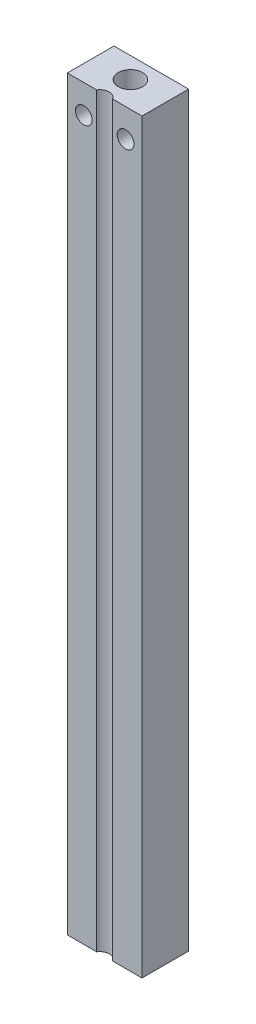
ISO-10303-21;
HEADER;
FILE_DESCRIPTION(('STEP AP214'),'2;1');
FILE_NAME('part.step','',(''),(''),'','','');
FILE_SCHEMA(('AUTOMOTIVE_DESIGN { 1 0 10303 214 1 1 1 1 }'));
ENDSEC;
DATA;
#1=APPLICATION_CONTEXT('core data for automotive mechanical design processes');
#2=APPLICATION_PROTOCOL_DEFINITION('international standard','automotive_design',2000,#1);
#3=PRODUCT_CONTEXT('',#1,'mechanical');
#4=PRODUCT('Part','Part','',(#3));
#5=PRODUCT_RELATED_PRODUCT_CATEGORY('part','',(#4));
#6=PRODUCT_DEFINITION_FORMATION('','',#4);
#7=PRODUCT_DEFINITION_CONTEXT('part definition',#1,'design');
#8=PRODUCT_DEFINITION('design','',#6,#7);
#9=PRODUCT_DEFINITION_SHAPE('','',#8);
#10=(LENGTH_UNIT() NAMED_UNIT(*) SI_UNIT(.MILLI.,.METRE.));
#11=(NAMED_UNIT(*) PLANE_ANGLE_UNIT() SI_UNIT($,.RADIAN.));
#12=(NAMED_UNIT(*) SI_UNIT($,.STERADIAN.) SOLID_ANGLE_UNIT());
#13=UNCERTAINTY_MEASURE_WITH_UNIT(LENGTH_MEASURE(1.E-05),#10,'distance_accuracy_value','');
#14=(GEOMETRIC_REPRESENTATION_CONTEXT(3) GLOBAL_UNCERTAINTY_ASSIGNED_CONTEXT((#13)) GLOBAL_UNIT_ASSIGNED_CONTEXT((#10,
#11,#12)) REPRESENTATION_CONTEXT('',''));
#15=CARTESIAN_POINT('',(0.,0.,0.));
#16=DIRECTION('',(0.,0.,1.));
#17=DIRECTION('',(1.,0.,0.));
#18=AXIS2_PLACEMENT_3D('',#15,#16,#17);
#19=CARTESIAN_POINT('',(0.,127.,0.));
#20=DIRECTION('',(1.,0.,0.));
#21=DIRECTION('',(0.,0.,-1.));
#22=AXIS2_PLACEMENT_3D('',#19,#20,#21);
#23=PLANE('',#22);
#24=DIRECTION('',(0.,0.,1.));
#25=VECTOR('',#24,1.);
#26=CARTESIAN_POINT('',(0.,0.,0.));
#27=LINE('',#26,#25);
#28=CARTESIAN_POINT('',(0.,0.,-7.9375));
#29=VERTEX_POINT('',#28);
#30=CARTESIAN_POINT('',(0.,0.,0.));
#31=VERTEX_POINT('',#30);
#32=EDGE_CURVE('E82',#29,#31,#27,.T.);
#33=ORIENTED_EDGE('',*,*,#32,.T.);
#34=DIRECTION('',(0.,-1.,0.));
#35=VECTOR('',#34,1.);
#36=CARTESIAN_POINT('',(0.,127.,0.));
#37=LINE('',#36,#35);
#38=CARTESIAN_POINT('',(0.,127.,0.));
#39=VERTEX_POINT('',#38);
#40=EDGE_CURVE('E11',#39,#31,#37,.T.);
#41=ORIENTED_EDGE('',*,*,#40,.F.);
#42=DIRECTION('',(0.,0.,1.));
#43=VECTOR('',#42,1.);
#44=CARTESIAN_POINT('',(0.,127.,0.));
#45=LINE('',#44,#43);
#46=CARTESIAN_POINT('',(0.,127.,-7.9375));
#47=VERTEX_POINT('',#46);
#48=EDGE_CURVE('E110',#47,#39,#45,.T.);
#49=ORIENTED_EDGE('',*,*,#48,.F.);
#50=DIRECTION('',(0.,-1.,0.));
#51=VECTOR('',#50,1.);
#52=CARTESIAN_POINT('',(0.,127.,-7.9375));
#53=LINE('',#52,#51);
#54=EDGE_CURVE('E95',#47,#29,#53,.T.);
#55=ORIENTED_EDGE('',*,*,#54,.T.);
#56=EDGE_LOOP('',(#33,#41,#49,#55));
#57=FACE_BOUND('',#56,.T.);
#58=ADVANCED_FACE('F26',(#57),#23,.F.);
#59=CARTESIAN_POINT('',(0.,127.,0.));
#60=DIRECTION('',(0.,0.,-1.));
#61=DIRECTION('',(-1.,0.,0.));
#62=AXIS2_PLACEMENT_3D('',#59,#60,#61);
#63=PLANE('',#62);
#64=CARTESIAN_POINT('',(2.794,122.174,0.));
#65=DIRECTION('',(0.,0.,1.));
#66=DIRECTION('',(1.,0.,0.));
#67=AXIS2_PLACEMENT_3D('',#64,#65,#66);
#68=CIRCLE('',#67,1.4224);
#69=CARTESIAN_POINT('',(4.2164,122.174,0.));
#70=VERTEX_POINT('',#69);
#71=EDGE_CURVE('E180',#70,#70,#68,.T.);
#72=ORIENTED_EDGE('',*,*,#71,.F.);
#73=EDGE_LOOP('',(#72));
#74=FACE_BOUND('',#73,.T.);
#75=DIRECTION('',(1.,0.,0.));
#76=VECTOR('',#75,1.);
#77=CARTESIAN_POINT('',(0.,0.,0.));
#78=LINE('',#77,#76);
#79=CARTESIAN_POINT('',(4.99401106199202,0.,0.));
#80=VERTEX_POINT('',#79);
#81=EDGE_CURVE('E78',#31,#80,#78,.T.);
#82=ORIENTED_EDGE('',*,*,#81,.T.);
#83=DIRECTION('',(0.,-1.,0.));
#84=VECTOR('',#83,1.);
#85=CARTESIAN_POINT('',(4.99401106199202,127.,0.));
#86=LINE('',#85,#84);
#87=CARTESIAN_POINT('',(4.99401106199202,127.,0.));
#88=VERTEX_POINT('',#87);
#89=EDGE_CURVE('E33',#88,#80,#86,.T.);
#90=ORIENTED_EDGE('',*,*,#89,.F.);
#91=DIRECTION('',(1.,0.,0.));
#92=VECTOR('',#91,1.);
#93=CARTESIAN_POINT('',(0.,127.,0.));
#94=LINE('',#93,#92);
#95=EDGE_CURVE('E91',#39,#88,#94,.T.);
#96=ORIENTED_EDGE('',*,*,#95,.F.);
#97=ORIENTED_EDGE('',*,*,#40,.T.);
#98=EDGE_LOOP('',(#82,#90,#96,#97));
#99=FACE_BOUND('',#98,.T.);
#100=ADVANCED_FACE('F90',(#74,#99),#63,.F.);
#101=CARTESIAN_POINT('',(6.35,127.,0.8255));
#102=DIRECTION('',(0.,-1.,0.));
#103=DIRECTION('',(0.,0.,-1.));
#104=AXIS2_PLACEMENT_3D('',#101,#102,#103);
#105=CYLINDRICAL_SURFACE('',#104,1.5875);
#106=CARTESIAN_POINT('',(6.35,0.,0.8255));
#107=DIRECTION('',(0.,-1.,0.));
#108=DIRECTION('',(0.,0.,1.));
#109=AXIS2_PLACEMENT_3D('',#106,#107,#108);
#110=CIRCLE('',#109,1.5875);
#111=CARTESIAN_POINT('',(7.70598893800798,0.,0.));
#112=VERTEX_POINT('',#111);
#113=EDGE_CURVE('E84',#80,#112,#110,.T.);
#114=ORIENTED_EDGE('',*,*,#113,.T.);
#115=DIRECTION('',(0.,-1.,0.));
#116=VECTOR('',#115,1.);
#117=CARTESIAN_POINT('',(7.70598893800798,127.,0.));
#118=LINE('',#117,#116);
#119=CARTESIAN_POINT('',(7.70598893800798,127.,0.));
#120=VERTEX_POINT('',#119);
#121=EDGE_CURVE('E126',#120,#112,#118,.T.);
#122=ORIENTED_EDGE('',*,*,#121,.F.);
#123=CARTESIAN_POINT('',(6.35,127.,0.8255));
#124=DIRECTION('',(0.,-1.,0.));
#125=DIRECTION('',(0.,0.,1.));
#126=AXIS2_PLACEMENT_3D('',#123,#124,#125);
#127=CIRCLE('',#126,1.5875);
#128=EDGE_CURVE('E113',#88,#120,#127,.T.);
#129=ORIENTED_EDGE('',*,*,#128,.F.);
#130=ORIENTED_EDGE('',*,*,#89,.T.);
#131=EDGE_LOOP('',(#114,#122,#129,#130));
#132=FACE_BOUND('',#131,.T.);
#133=ADVANCED_FACE('F130',(#132),#105,.F.);
#134=CARTESIAN_POINT('',(7.70598893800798,127.,0.));
#135=DIRECTION('',(0.,0.,-1.));
#136=DIRECTION('',(-1.,0.,0.));
#137=AXIS2_PLACEMENT_3D('',#134,#135,#136);
#138=PLANE('',#137);
#139=CARTESIAN_POINT('',(9.906,122.174,0.));
#140=DIRECTION('',(0.,0.,1.));
#141=DIRECTION('',(1.,0.,0.));
#142=AXIS2_PLACEMENT_3D('',#139,#140,#141);
#143=CIRCLE('',#142,1.4224);
#144=CARTESIAN_POINT('',(11.3284,122.174,0.));
#145=VERTEX_POINT('',#144);
#146=EDGE_CURVE('E173',#145,#145,#143,.T.);
#147=ORIENTED_EDGE('',*,*,#146,.F.);
#148=EDGE_LOOP('',(#147));
#149=FACE_BOUND('',#148,.T.);
#150=DIRECTION('',(1.,0.,0.));
#151=VECTOR('',#150,1.);
#152=CARTESIAN_POINT('',(7.70598893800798,0.,0.));
#153=LINE('',#152,#151);
#154=CARTESIAN_POINT('',(12.7,0.,0.));
#155=VERTEX_POINT('',#154);
#156=EDGE_CURVE('E104',#112,#155,#153,.T.);
#157=ORIENTED_EDGE('',*,*,#156,.T.);
#158=DIRECTION('',(0.,-1.,0.));
#159=VECTOR('',#158,1.);
#160=CARTESIAN_POINT('',(12.7,127.,0.));
#161=LINE('',#160,#159);
#162=CARTESIAN_POINT('',(12.7,127.,0.));
#163=VERTEX_POINT('',#162);
#164=EDGE_CURVE('E123',#163,#155,#161,.T.);
#165=ORIENTED_EDGE('',*,*,#164,.F.);
#166=DIRECTION('',(1.,0.,0.));
#167=VECTOR('',#166,1.);
#168=CARTESIAN_POINT('',(7.70598893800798,127.,0.));
#169=LINE('',#168,#167);
#170=EDGE_CURVE('E115',#120,#163,#169,.T.);
#171=ORIENTED_EDGE('',*,*,#170,.F.);
#172=ORIENTED_EDGE('',*,*,#121,.T.);
#173=EDGE_LOOP('',(#157,#165,#171,#172));
#174=FACE_BOUND('',#173,.T.);
#175=ADVANCED_FACE('F136',(#149,#174),#138,.F.);
#176=CARTESIAN_POINT('',(12.7,127.,0.));
#177=DIRECTION('',(-1.,0.,0.));
#178=DIRECTION('',(0.,0.,1.));
#179=AXIS2_PLACEMENT_3D('',#176,#177,#178);
#180=PLANE('',#179);
#181=DIRECTION('',(0.,0.,-1.));
#182=VECTOR('',#181,1.);
#183=CARTESIAN_POINT('',(12.7,0.,0.));
#184=LINE('',#183,#182);
#185=CARTESIAN_POINT('',(12.7,0.,-7.9375));
#186=VERTEX_POINT('',#185);
#187=EDGE_CURVE('E106',#155,#186,#184,.T.);
#188=ORIENTED_EDGE('',*,*,#187,.T.);
#189=DIRECTION('',(0.,-1.,0.));
#190=VECTOR('',#189,1.);
#191=CARTESIAN_POINT('',(12.7,127.,-7.9375));
#192=LINE('',#191,#190);
#193=CARTESIAN_POINT('',(12.7,127.,-7.9375));
#194=VERTEX_POINT('',#193);
#195=EDGE_CURVE('E120',#194,#186,#192,.T.);
#196=ORIENTED_EDGE('',*,*,#195,.F.);
#197=DIRECTION('',(0.,0.,-1.));
#198=VECTOR('',#197,1.);
#199=CARTESIAN_POINT('',(12.7,127.,0.));
#200=LINE('',#199,#198);
#201=EDGE_CURVE('E45',#163,#194,#200,.T.);
#202=ORIENTED_EDGE('',*,*,#201,.F.);
#203=ORIENTED_EDGE('',*,*,#164,.T.);
#204=EDGE_LOOP('',(#188,#196,#202,#203));
#205=FACE_BOUND('',#204,.T.);
#206=ADVANCED_FACE('F139',(#205),#180,.F.);
#207=CARTESIAN_POINT('',(0.,127.,-7.9375));
#208=DIRECTION('',(0.,0.,1.));
#209=DIRECTION('',(1.,0.,0.));
#210=AXIS2_PLACEMENT_3D('',#207,#208,#209);
#211=PLANE('',#210);
#212=CARTESIAN_POINT('',(2.794,122.174,-7.9375));
#213=DIRECTION('',(0.,0.,1.));
#214=DIRECTION('',(1.,0.,0.));
#215=AXIS2_PLACEMENT_3D('',#212,#213,#214);
#216=CIRCLE('',#215,1.4224);
#217=CARTESIAN_POINT('',(4.2164,122.174,-7.9375));
#218=VERTEX_POINT('',#217);
#219=EDGE_CURVE('E176',#218,#218,#216,.T.);
#220=ORIENTED_EDGE('',*,*,#219,.T.);
#221=EDGE_LOOP('',(#220));
#222=FACE_BOUND('',#221,.T.);
#223=CARTESIAN_POINT('',(9.906,122.174,-7.9375));
#224=DIRECTION('',(0.,0.,1.));
#225=DIRECTION('',(1.,0.,0.));
#226=AXIS2_PLACEMENT_3D('',#223,#224,#225);
#227=CIRCLE('',#226,1.4224);
#228=CARTESIAN_POINT('',(11.3284,122.174,-7.9375));
#229=VERTEX_POINT('',#228);
#230=EDGE_CURVE('E175',#229,#229,#227,.T.);
#231=ORIENTED_EDGE('',*,*,#230,.T.);
#232=EDGE_LOOP('',(#231));
#233=FACE_BOUND('',#232,.T.);
#234=DIRECTION('',(-1.,0.,0.));
#235=VECTOR('',#234,1.);
#236=CARTESIAN_POINT('',(0.,0.,-7.9375));
#237=LINE('',#236,#235);
#238=EDGE_CURVE('E108',#186,#29,#237,.T.);
#239=ORIENTED_EDGE('',*,*,#238,.T.);
#240=ORIENTED_EDGE('',*,*,#54,.F.);
#241=DIRECTION('',(-1.,0.,0.));
#242=VECTOR('',#241,1.);
#243=CARTESIAN_POINT('',(0.,127.,-7.9375));
#244=LINE('',#243,#242);
#245=EDGE_CURVE('E40',#194,#47,#244,.T.);
#246=ORIENTED_EDGE('',*,*,#245,.F.);
#247=ORIENTED_EDGE('',*,*,#195,.T.);
#248=EDGE_LOOP('',(#239,#240,#246,#247));
#249=FACE_BOUND('',#248,.T.);
#250=ADVANCED_FACE('F141',(#222,#233,#249),#211,.F.);
#251=CARTESIAN_POINT('',(6.35,127.,0.8255));
#252=DIRECTION('',(0.,1.,0.));
#253=DIRECTION('',(0.,0.,1.));
#254=AXIS2_PLACEMENT_3D('',#251,#252,#253);
#255=PLANE('',#254);
#256=CARTESIAN_POINT('',(6.35,127.,-4.3815));
#257=DIRECTION('',(0.,1.,0.));
#258=DIRECTION('',(0.,0.,1.));
#259=AXIS2_PLACEMENT_3D('',#256,#257,#258);
#260=CIRCLE('',#259,2.0828);
#261=CARTESIAN_POINT('',(6.35,127.,-2.2987));
#262=VERTEX_POINT('',#261);
#263=EDGE_CURVE('E99',#262,#262,#260,.T.);
#264=ORIENTED_EDGE('',*,*,#263,.F.);
#265=EDGE_LOOP('',(#264));
#266=FACE_BOUND('',#265,.T.);
#267=ORIENTED_EDGE('',*,*,#48,.T.);
#268=ORIENTED_EDGE('',*,*,#95,.T.);
#269=ORIENTED_EDGE('',*,*,#128,.T.);
#270=ORIENTED_EDGE('',*,*,#170,.T.);
#271=ORIENTED_EDGE('',*,*,#201,.T.);
#272=ORIENTED_EDGE('',*,*,#245,.T.);
#273=EDGE_LOOP('',(#267,#268,#269,#270,#271,#272));
#274=FACE_BOUND('',#273,.T.);
#275=ADVANCED_FACE('F133',(#266,#274),#255,.T.);
#276=CARTESIAN_POINT('',(6.35,0.,0.8255));
#277=DIRECTION('',(0.,1.,0.));
#278=DIRECTION('',(0.,0.,1.));
#279=AXIS2_PLACEMENT_3D('',#276,#277,#278);
#280=PLANE('',#279);
#281=CARTESIAN_POINT('',(6.35,0.,-2.794));
#282=DIRECTION('',(0.,-1.,0.));
#283=DIRECTION('',(0.,0.,-1.));
#284=AXIS2_PLACEMENT_3D('',#281,#282,#283);
#285=CIRCLE('',#284,1.6256);
#286=CARTESIAN_POINT('',(6.35,0.,-4.4196));
#287=VERTEX_POINT('',#286);
#288=EDGE_CURVE('E219',#287,#287,#285,.T.);
#289=ORIENTED_EDGE('',*,*,#288,.F.);
#290=EDGE_LOOP('',(#289));
#291=FACE_BOUND('',#290,.T.);
#292=ORIENTED_EDGE('',*,*,#32,.F.);
#293=ORIENTED_EDGE('',*,*,#238,.F.);
#294=ORIENTED_EDGE('',*,*,#187,.F.);
#295=ORIENTED_EDGE('',*,*,#156,.F.);
#296=ORIENTED_EDGE('',*,*,#113,.F.);
#297=ORIENTED_EDGE('',*,*,#81,.F.);
#298=EDGE_LOOP('',(#292,#293,#294,#295,#296,#297));
#299=FACE_BOUND('',#298,.T.);
#300=ADVANCED_FACE('F79',(#291,#299),#280,.F.);
#301=CARTESIAN_POINT('',(6.35,114.3,-4.3815));
#302=DIRECTION('',(0.,1.,0.));
#303=DIRECTION('',(0.,0.,1.));
#304=AXIS2_PLACEMENT_3D('',#301,#302,#303);
#305=CYLINDRICAL_SURFACE('',#304,2.0828);
#306=CARTESIAN_POINT('',(6.35,114.3,-4.3815));
#307=DIRECTION('',(0.,1.,0.));
#308=DIRECTION('',(0.,0.,1.));
#309=AXIS2_PLACEMENT_3D('',#306,#307,#308);
#310=CIRCLE('',#309,2.0828);
#311=CARTESIAN_POINT('',(6.35,114.3,-2.2987));
#312=VERTEX_POINT('',#311);
#313=EDGE_CURVE('E96',#312,#312,#310,.T.);
#314=ORIENTED_EDGE('',*,*,#313,.F.);
#315=EDGE_LOOP('',(#314));
#316=FACE_BOUND('',#315,.T.);
#317=ORIENTED_EDGE('',*,*,#263,.T.);
#318=EDGE_LOOP('',(#317));
#319=FACE_BOUND('',#318,.T.);
#320=ADVANCED_FACE('F186',(#316,#319),#305,.F.);
#321=CARTESIAN_POINT('',(6.35,114.3,-4.3815));
#322=DIRECTION('',(0.,1.,0.));
#323=DIRECTION('',(0.,0.,1.));
#324=AXIS2_PLACEMENT_3D('',#321,#322,#323);
#325=PLANE('',#324);
#326=ORIENTED_EDGE('',*,*,#313,.T.);
#327=EDGE_LOOP('',(#326));
#328=FACE_BOUND('',#327,.T.);
#329=ADVANCED_FACE('F188',(#328),#325,.T.);
#330=CARTESIAN_POINT('',(9.906,122.174,-7.9375));
#331=DIRECTION('',(0.,0.,1.));
#332=DIRECTION('',(1.,0.,0.));
#333=AXIS2_PLACEMENT_3D('',#330,#331,#332);
#334=CYLINDRICAL_SURFACE('',#333,1.4224);
#335=ORIENTED_EDGE('',*,*,#230,.F.);
#336=EDGE_LOOP('',(#335));
#337=FACE_BOUND('',#336,.T.);
#338=ORIENTED_EDGE('',*,*,#146,.T.);
#339=EDGE_LOOP('',(#338));
#340=FACE_BOUND('',#339,.T.);
#341=ADVANCED_FACE('F193',(#337,#340),#334,.F.);
#342=CARTESIAN_POINT('',(2.794,122.174,-7.9375));
#343=DIRECTION('',(0.,0.,1.));
#344=DIRECTION('',(1.,0.,0.));
#345=AXIS2_PLACEMENT_3D('',#342,#343,#344);
#346=CYLINDRICAL_SURFACE('',#345,1.4224);
#347=ORIENTED_EDGE('',*,*,#219,.F.);
#348=EDGE_LOOP('',(#347));
#349=FACE_BOUND('',#348,.T.);
#350=ORIENTED_EDGE('',*,*,#71,.T.);
#351=EDGE_LOOP('',(#350));
#352=FACE_BOUND('',#351,.T.);
#353=ADVANCED_FACE('F202',(#349,#352),#346,.F.);
#354=CARTESIAN_POINT('',(6.35,12.7,-2.794));
#355=DIRECTION('',(0.,-1.,0.));
#356=DIRECTION('',(0.,0.,-1.));
#357=AXIS2_PLACEMENT_3D('',#354,#355,#356);
#358=CYLINDRICAL_SURFACE('',#357,1.6256);
#359=CARTESIAN_POINT('',(6.35,12.7,-2.794));
#360=DIRECTION('',(0.,-1.,0.));
#361=DIRECTION('',(0.,0.,-1.));
#362=AXIS2_PLACEMENT_3D('',#359,#360,#361);
#363=CIRCLE('',#362,1.6256);
#364=CARTESIAN_POINT('',(6.35,12.7,-4.4196));
#365=VERTEX_POINT('',#364);
#366=EDGE_CURVE('E218',#365,#365,#363,.T.);
#367=ORIENTED_EDGE('',*,*,#366,.F.);
#368=EDGE_LOOP('',(#367));
#369=FACE_BOUND('',#368,.T.);
#370=ORIENTED_EDGE('',*,*,#288,.T.);
#371=EDGE_LOOP('',(#370));
#372=FACE_BOUND('',#371,.T.);
#373=ADVANCED_FACE('F206',(#369,#372),#358,.F.);
#374=CARTESIAN_POINT('',(6.35,12.7,-2.794));
#375=DIRECTION('',(0.,-1.,0.));
#376=DIRECTION('',(0.,0.,-1.));
#377=AXIS2_PLACEMENT_3D('',#374,#375,#376);
#378=PLANE('',#377);
#379=ORIENTED_EDGE('',*,*,#366,.T.);
#380=EDGE_LOOP('',(#379));
#381=FACE_BOUND('',#380,.T.);
#382=ADVANCED_FACE('F210',(#381),#378,.T.);
#383=CLOSED_SHELL('',(#58,#100,#133,#175,#206,#250,#275,#300,#320,#329,#341,#353,#373,#382));
#384=MANIFOLD_SOLID_BREP('B2',#383);
#385=ADVANCED_BREP_SHAPE_REPRESENTATION('',(#18,#384),#14);
#386=SHAPE_DEFINITION_REPRESENTATION(#9,#385);
ENDSEC;
END-ISO-10303-21;
